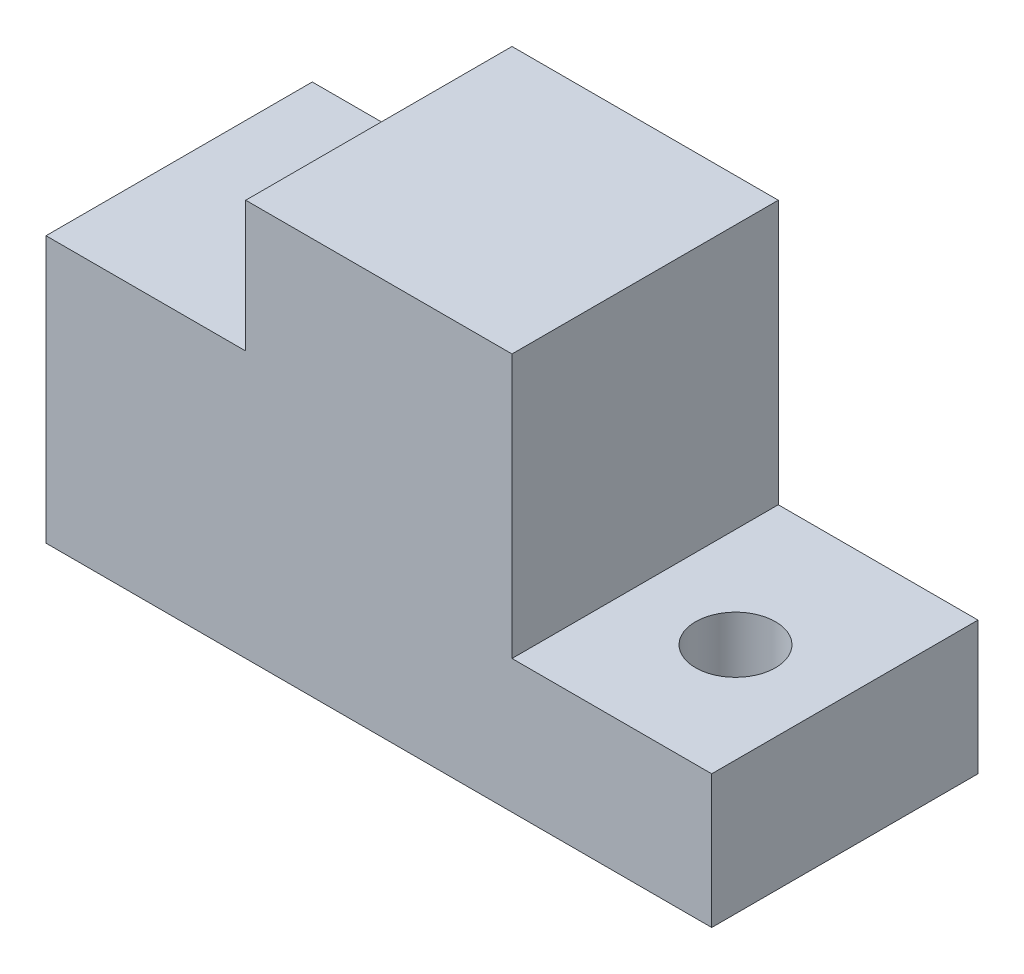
from build123d import *

# Parameters (mm, degrees)
RESSALTO_EXTRUS_O1_DEPTH = 20
ESBO_O2_R                = 3
CORTE_EXTRUS_O1_DEPTH    = 20


with BuildPart() as part:
    # Esbo_o1 → Ressalto-extrus_o1 (new body)
    with BuildSketch(Plane.XY):
        Polygon((0, 0), (0, -20), (50, -20), (50, -10), (35, -10), (35, 9.809047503), (15, 9.809047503), (15, 0), align=None)
    extrude(amount=RESSALTO_EXTRUS_O1_DEPTH)

    # Esbo_o2 → Corte-extrus_o1 (cut)
    with BuildSketch(Plane(origin=(0, -10, 0), x_dir=(1, 0, 0), z_dir=(0, 1, 0))):
        with Locations(Location((42.5, -10.712031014, 0), (0, 0, 180))):
            Circle(ESBO_O2_R)
    extrude(amount=-CORTE_EXTRUS_O1_DEPTH, mode=Mode.SUBTRACT)


solid = part.part
